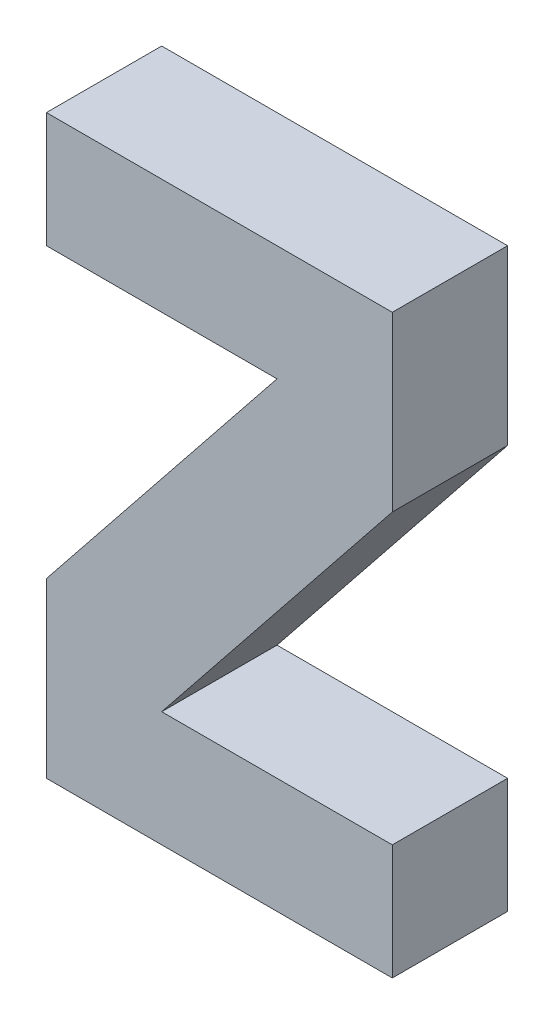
from build123d import *

# Parameters (mm, degrees)
BOSS_EXTRU_1_DEPTH = 10


with BuildPart() as part:
    # Esquisse1 → Boss.-Extru.1 (new body)
    with BuildSketch(Plane.XY):
        Polygon((0, 40), (20, 40), (0, 15), (0, 0), (30, 0), (30, 10), (10, 10), (30, 35), (30, 50), (0, 50), align=None)
    extrude(amount=BOSS_EXTRU_1_DEPTH)


solid = part.part
